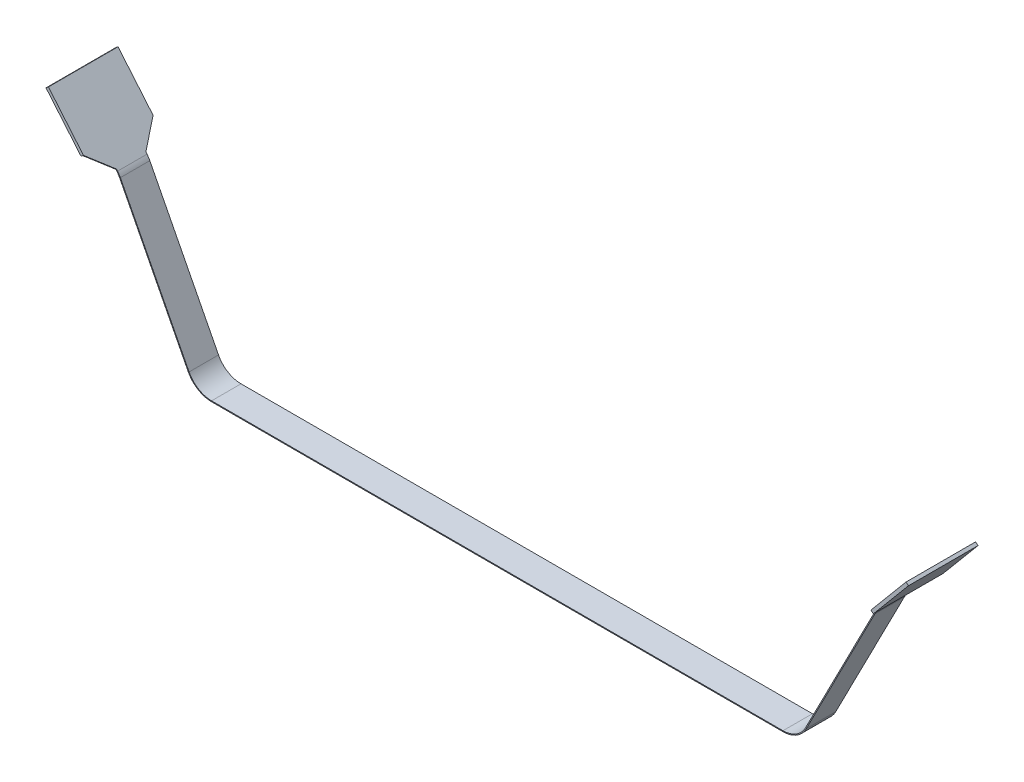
ISO-10303-21;
HEADER;
FILE_DESCRIPTION(('STEP AP214'),'2;1');
FILE_NAME('part.step','',(''),(''),'','','');
FILE_SCHEMA(('AUTOMOTIVE_DESIGN { 1 0 10303 214 1 1 1 1 }'));
ENDSEC;
DATA;
#1=APPLICATION_CONTEXT('core data for automotive mechanical design processes');
#2=APPLICATION_PROTOCOL_DEFINITION('international standard','automotive_design',2000,#1);
#3=PRODUCT_CONTEXT('',#1,'mechanical');
#4=PRODUCT('Part','Part','',(#3));
#5=PRODUCT_RELATED_PRODUCT_CATEGORY('part','',(#4));
#6=PRODUCT_DEFINITION_FORMATION('','',#4);
#7=PRODUCT_DEFINITION_CONTEXT('part definition',#1,'design');
#8=PRODUCT_DEFINITION('design','',#6,#7);
#9=PRODUCT_DEFINITION_SHAPE('','',#8);
#10=(LENGTH_UNIT() NAMED_UNIT(*) SI_UNIT(.MILLI.,.METRE.));
#11=(NAMED_UNIT(*) PLANE_ANGLE_UNIT() SI_UNIT($,.RADIAN.));
#12=(NAMED_UNIT(*) SI_UNIT($,.STERADIAN.) SOLID_ANGLE_UNIT());
#13=UNCERTAINTY_MEASURE_WITH_UNIT(LENGTH_MEASURE(1.E-05),#10,'distance_accuracy_value','');
#14=(GEOMETRIC_REPRESENTATION_CONTEXT(3) GLOBAL_UNCERTAINTY_ASSIGNED_CONTEXT((#13)) GLOBAL_UNIT_ASSIGNED_CONTEXT((#10,
#11,#12)) REPRESENTATION_CONTEXT('',''));
#15=CARTESIAN_POINT('',(0.,0.,0.));
#16=DIRECTION('',(0.,0.,1.));
#17=DIRECTION('',(1.,0.,0.));
#18=AXIS2_PLACEMENT_3D('',#15,#16,#17);
#19=CARTESIAN_POINT('',(-174.96483840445,-29.3539118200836,15.954));
#20=DIRECTION('',(0.766044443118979,0.642787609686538,0.));
#21=DIRECTION('',(-0.642787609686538,0.766044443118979,0.));
#22=AXIS2_PLACEMENT_3D('',#19,#20,#21);
#23=PLANE('',#22);
#24=DIRECTION('',(0.,0.,1.));
#25=VECTOR('',#24,1.);
#26=CARTESIAN_POINT('',(-180.881055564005,-22.3032387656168,-15.954));
#27=LINE('',#26,#25);
#28=CARTESIAN_POINT('',(-180.881055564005,-22.3032387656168,-15.954));
#29=VERTEX_POINT('',#28);
#30=CARTESIAN_POINT('',(-180.881055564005,-22.3032387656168,15.954));
#31=VERTEX_POINT('',#30);
#32=EDGE_CURVE('E306',#29,#31,#27,.T.);
#33=ORIENTED_EDGE('',*,*,#32,.F.);
#34=DIRECTION('',(0.454519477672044,-0.541675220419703,0.707106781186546));
#35=VECTOR('',#34,1.);
#36=CARTESIAN_POINT('',(-174.96483840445,-29.3539118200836,-6.75000000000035));
#37=LINE('',#36,#35);
#38=CARTESIAN_POINT('',(-174.96483840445,-29.3539118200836,-6.75000000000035));
#39=VERTEX_POINT('',#38);
#40=EDGE_CURVE('E327',#29,#39,#37,.T.);
#41=ORIENTED_EDGE('',*,*,#40,.T.);
#42=DIRECTION('',(0.,0.,1.));
#43=VECTOR('',#42,1.);
#44=CARTESIAN_POINT('',(-174.96483840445,-29.3539118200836,6.75000000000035));
#45=LINE('',#44,#43);
#46=CARTESIAN_POINT('',(-174.96483840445,-29.3539118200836,6.75000000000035));
#47=VERTEX_POINT('',#46);
#48=EDGE_CURVE('E329',#39,#47,#45,.T.);
#49=ORIENTED_EDGE('',*,*,#48,.T.);
#50=DIRECTION('',(-0.454519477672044,0.541675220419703,0.707106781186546));
#51=VECTOR('',#50,1.);
#52=CARTESIAN_POINT('',(-174.96483840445,-29.3539118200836,6.75000000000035));
#53=LINE('',#52,#51);
#54=EDGE_CURVE('E332',#47,#31,#53,.T.);
#55=ORIENTED_EDGE('',*,*,#54,.T.);
#56=EDGE_LOOP('',(#33,#41,#49,#55));
#57=FACE_BOUND('',#56,.T.);
#58=ADVANCED_FACE('F31',(#57),#23,.F.);
#59=CARTESIAN_POINT('',(-196.912443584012,-3.11998830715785,-6.75000000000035));
#60=DIRECTION('',(0.76604444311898,0.642787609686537,0.));
#61=DIRECTION('',(-0.642787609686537,0.76604444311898,0.));
#62=AXIS2_PLACEMENT_3D('',#59,#60,#61);
#63=PLANE('',#62);
#64=DIRECTION('',(0.,0.,1.));
#65=VECTOR('',#64,1.);
#66=CARTESIAN_POINT('',(-174.926536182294,-29.3217724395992,-6.75000000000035));
#67=LINE('',#66,#65);
#68=CARTESIAN_POINT('',(-174.926536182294,-29.3217724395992,-6.75000000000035));
#69=VERTEX_POINT('',#68);
#70=CARTESIAN_POINT('',(-174.926536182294,-29.3217724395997,6.74999999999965));
#71=VERTEX_POINT('',#70);
#72=EDGE_CURVE('E361',#69,#71,#67,.T.);
#73=ORIENTED_EDGE('',*,*,#72,.F.);
#74=DIRECTION('',(-0.642787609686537,0.76604444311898,0.));
#75=VECTOR('',#74,1.);
#76=CARTESIAN_POINT('',(-196.912443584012,-3.11998830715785,-6.75000000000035));
#77=LINE('',#76,#75);
#78=CARTESIAN_POINT('',(-174.414877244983,-29.9315438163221,-6.75000000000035));
#79=VERTEX_POINT('',#78);
#80=EDGE_CURVE('E365',#79,#69,#77,.T.);
#81=ORIENTED_EDGE('',*,*,#80,.F.);
#82=DIRECTION('',(0.,0.,1.));
#83=VECTOR('',#82,1.);
#84=CARTESIAN_POINT('',(-174.414877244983,-29.9315438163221,-6.75000000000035));
#85=LINE('',#84,#83);
#86=CARTESIAN_POINT('',(-174.414877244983,-29.9315438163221,6.74999999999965));
#87=VERTEX_POINT('',#86);
#88=EDGE_CURVE('E410',#79,#87,#85,.T.);
#89=ORIENTED_EDGE('',*,*,#88,.T.);
#90=DIRECTION('',(-0.642787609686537,0.76604444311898,0.));
#91=VECTOR('',#90,1.);
#92=CARTESIAN_POINT('',(-196.912443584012,-3.11998830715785,6.74999999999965));
#93=LINE('',#92,#91);
#94=EDGE_CURVE('E364',#87,#71,#93,.T.);
#95=ORIENTED_EDGE('',*,*,#94,.T.);
#96=EDGE_LOOP('',(#73,#81,#89,#95));
#97=FACE_BOUND('',#96,.T.);
#98=ADVANCED_FACE('F33',(#97),#63,.F.);
#99=CARTESIAN_POINT('',(-182.075321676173,-36.3594199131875,-6.75000000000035));
#100=DIRECTION('',(0.,0.,-1.));
#101=DIRECTION('',(-1.,0.,0.));
#102=AXIS2_PLACEMENT_3D('',#99,#100,#101);
#103=PLANE('',#102);
#104=DIRECTION('',(-0.766044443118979,0.642787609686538,0.));
#105=VECTOR('',#104,1.);
#106=CARTESIAN_POINT('',(174.96483840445,-29.3539118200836,-6.75000000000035));
#107=LINE('',#106,#105);
#108=CARTESIAN_POINT('',(174.926536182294,-29.3217724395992,-6.75000000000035));
#109=VERTEX_POINT('',#108);
#110=CARTESIAN_POINT('',(174.620118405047,-29.0646573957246,-6.75000000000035));
#111=VERTEX_POINT('',#110);
#112=EDGE_CURVE('E297',#109,#111,#107,.T.);
#113=ORIENTED_EDGE('',*,*,#112,.F.);
#114=DIRECTION('',(-0.642787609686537,-0.76604444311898,0.));
#115=VECTOR('',#114,1.);
#116=CARTESIAN_POINT('',(196.912443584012,-3.11998830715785,-6.75000000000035));
#117=LINE('',#116,#115);
#118=CARTESIAN_POINT('',(174.414877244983,-29.9315438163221,-6.75000000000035));
#119=VERTEX_POINT('',#118);
#120=EDGE_CURVE('E394',#109,#119,#117,.T.);
#121=ORIENTED_EDGE('',*,*,#120,.T.);
#122=CARTESIAN_POINT('',(182.075321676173,-36.3594199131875,-6.75000000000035));
#123=DIRECTION('',(0.,0.,1.));
#124=DIRECTION('',(1.,0.,0.));
#125=AXIS2_PLACEMENT_3D('',#122,#123,#124);
#126=CIRCLE('',#125,10.);
#127=CARTESIAN_POINT('',(173.178162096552,-31.7942746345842,-6.75000000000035));
#128=VERTEX_POINT('',#127);
#129=EDGE_CURVE('E396',#119,#128,#126,.T.);
#130=ORIENTED_EDGE('',*,*,#129,.T.);
#131=DIRECTION('',(-0.456514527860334,-0.889715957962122,0.));
#132=VECTOR('',#131,1.);
#133=CARTESIAN_POINT('',(173.178162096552,-31.7942746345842,-6.75000000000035));
#134=LINE('',#133,#132);
#135=CARTESIAN_POINT('',(141.676591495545,-93.188706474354,-6.75000000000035));
#136=VERTEX_POINT('',#135);
#137=EDGE_CURVE('E398',#128,#136,#134,.T.);
#138=ORIENTED_EDGE('',*,*,#137,.T.);
#139=CARTESIAN_POINT('',(131.,-87.71053214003,-6.75000000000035));
#140=DIRECTION('',(0.,0.,-1.));
#141=DIRECTION('',(1.,0.,0.));
#142=AXIS2_PLACEMENT_3D('',#139,#140,#141);
#143=CIRCLE('',#142,12.);
#144=CARTESIAN_POINT('',(131.,-99.71053214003,-6.75000000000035));
#145=VERTEX_POINT('',#144);
#146=EDGE_CURVE('E400',#136,#145,#143,.T.);
#147=ORIENTED_EDGE('',*,*,#146,.T.);
#148=DIRECTION('',(-1.,0.,0.));
#149=VECTOR('',#148,1.);
#150=CARTESIAN_POINT('',(-131.,-99.71053214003,-6.75000000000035));
#151=LINE('',#150,#149);
#152=CARTESIAN_POINT('',(-131.,-99.71053214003,-6.75000000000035));
#153=VERTEX_POINT('',#152);
#154=EDGE_CURVE('E402',#145,#153,#151,.T.);
#155=ORIENTED_EDGE('',*,*,#154,.T.);
#156=CARTESIAN_POINT('',(-131.,-87.71053214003,-6.75000000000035));
#157=DIRECTION('',(0.,0.,-1.));
#158=DIRECTION('',(-1.,0.,0.));
#159=AXIS2_PLACEMENT_3D('',#156,#157,#158);
#160=CIRCLE('',#159,12.);
#161=CARTESIAN_POINT('',(-141.676591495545,-93.188706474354,-6.75000000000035));
#162=VERTEX_POINT('',#161);
#163=EDGE_CURVE('E404',#153,#162,#160,.T.);
#164=ORIENTED_EDGE('',*,*,#163,.T.);
#165=DIRECTION('',(-0.456514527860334,0.889715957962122,0.));
#166=VECTOR('',#165,1.);
#167=CARTESIAN_POINT('',(-173.178162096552,-31.7942746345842,-6.75000000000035));
#168=LINE('',#167,#166);
#169=CARTESIAN_POINT('',(-173.178162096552,-31.7942746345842,-6.75000000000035));
#170=VERTEX_POINT('',#169);
#171=EDGE_CURVE('E406',#162,#170,#168,.T.);
#172=ORIENTED_EDGE('',*,*,#171,.T.);
#173=CARTESIAN_POINT('',(-182.075321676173,-36.3594199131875,-6.75000000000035));
#174=DIRECTION('',(0.,0.,1.));
#175=DIRECTION('',(-1.,0.,0.));
#176=AXIS2_PLACEMENT_3D('',#173,#174,#175);
#177=CIRCLE('',#176,10.);
#178=EDGE_CURVE('E408',#170,#79,#177,.T.);
#179=ORIENTED_EDGE('',*,*,#178,.T.);
#180=ORIENTED_EDGE('',*,*,#80,.T.);
#181=DIRECTION('',(0.766044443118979,0.642787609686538,0.));
#182=VECTOR('',#181,1.);
#183=CARTESIAN_POINT('',(-174.96483840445,-29.3539118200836,-6.75000000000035));
#184=LINE('',#183,#182);
#185=CARTESIAN_POINT('',(-174.620118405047,-29.0646573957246,-6.75000000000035));
#186=VERTEX_POINT('',#185);
#187=EDGE_CURVE('E348',#69,#186,#184,.T.);
#188=ORIENTED_EDGE('',*,*,#187,.T.);
#189=DIRECTION('',(-0.642787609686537,0.76604444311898,0.));
#190=VECTOR('',#189,1.);
#191=CARTESIAN_POINT('',(-196.606025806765,-2.86287326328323,-6.75000000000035));
#192=LINE('',#191,#190);
#193=CARTESIAN_POINT('',(-174.108459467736,-29.6744287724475,-6.75000000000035));
#194=VERTEX_POINT('',#193);
#195=EDGE_CURVE('E368',#194,#186,#192,.T.);
#196=ORIENTED_EDGE('',*,*,#195,.F.);
#197=CARTESIAN_POINT('',(-182.075321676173,-36.3594199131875,-6.75000000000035));
#198=DIRECTION('',(0.,0.,-1.));
#199=DIRECTION('',(1.,0.,0.));
#200=AXIS2_PLACEMENT_3D('',#197,#198,#199);
#201=CIRCLE('',#200,10.4);
#202=CARTESIAN_POINT('',(-172.822275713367,-31.61166882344,-6.75000000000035));
#203=VERTEX_POINT('',#202);
#204=EDGE_CURVE('E372',#203,#194,#201,.F.);
#205=ORIENTED_EDGE('',*,*,#204,.F.);
#206=DIRECTION('',(-0.456514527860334,0.889715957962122,0.));
#207=VECTOR('',#206,1.);
#208=CARTESIAN_POINT('',(-172.822275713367,-31.61166882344,-6.75000000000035));
#209=LINE('',#208,#207);
#210=CARTESIAN_POINT('',(-141.320705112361,-93.0061006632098,-6.75000000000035));
#211=VERTEX_POINT('',#210);
#212=EDGE_CURVE('E375',#211,#203,#209,.T.);
#213=ORIENTED_EDGE('',*,*,#212,.F.);
#214=CARTESIAN_POINT('',(-131.,-87.71053214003,-6.75000000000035));
#215=DIRECTION('',(0.,0.,-1.));
#216=DIRECTION('',(1.,0.,0.));
#217=AXIS2_PLACEMENT_3D('',#214,#215,#216);
#218=CIRCLE('',#217,11.6);
#219=CARTESIAN_POINT('',(-131.,-99.31053214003,-6.75000000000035));
#220=VERTEX_POINT('',#219);
#221=EDGE_CURVE('E378',#220,#211,#218,.T.);
#222=ORIENTED_EDGE('',*,*,#221,.F.);
#223=DIRECTION('',(1.,0.,0.));
#224=VECTOR('',#223,1.);
#225=CARTESIAN_POINT('',(-131.,-99.31053214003,-6.75000000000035));
#226=LINE('',#225,#224);
#227=CARTESIAN_POINT('',(131.,-99.31053214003,-6.75000000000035));
#228=VERTEX_POINT('',#227);
#229=EDGE_CURVE('E381',#228,#220,#226,.F.);
#230=ORIENTED_EDGE('',*,*,#229,.F.);
#231=CARTESIAN_POINT('',(131.,-87.71053214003,-6.75000000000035));
#232=DIRECTION('',(0.,0.,-1.));
#233=DIRECTION('',(1.,0.,0.));
#234=AXIS2_PLACEMENT_3D('',#231,#232,#233);
#235=CIRCLE('',#234,11.6);
#236=CARTESIAN_POINT('',(141.320705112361,-93.0061006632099,-6.75000000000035));
#237=VERTEX_POINT('',#236);
#238=EDGE_CURVE('E384',#237,#228,#235,.T.);
#239=ORIENTED_EDGE('',*,*,#238,.F.);
#240=DIRECTION('',(-0.456514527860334,-0.889715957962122,0.));
#241=VECTOR('',#240,1.);
#242=CARTESIAN_POINT('',(172.822275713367,-31.61166882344,-6.75000000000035));
#243=LINE('',#242,#241);
#244=CARTESIAN_POINT('',(172.822275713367,-31.61166882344,-6.75000000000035));
#245=VERTEX_POINT('',#244);
#246=EDGE_CURVE('E387',#245,#237,#243,.T.);
#247=ORIENTED_EDGE('',*,*,#246,.F.);
#248=CARTESIAN_POINT('',(182.075321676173,-36.3594199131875,-6.75000000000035));
#249=DIRECTION('',(0.,0.,-1.));
#250=DIRECTION('',(1.,0.,0.));
#251=AXIS2_PLACEMENT_3D('',#248,#249,#250);
#252=CIRCLE('',#251,10.4);
#253=CARTESIAN_POINT('',(174.108459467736,-29.6744287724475,-6.75000000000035));
#254=VERTEX_POINT('',#253);
#255=EDGE_CURVE('E390',#254,#245,#252,.F.);
#256=ORIENTED_EDGE('',*,*,#255,.F.);
#257=DIRECTION('',(-0.642787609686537,-0.76604444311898,0.));
#258=VECTOR('',#257,1.);
#259=CARTESIAN_POINT('',(196.606025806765,-2.86287326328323,-6.75000000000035));
#260=LINE('',#259,#258);
#261=EDGE_CURVE('E46',#111,#254,#260,.T.);
#262=ORIENTED_EDGE('',*,*,#261,.F.);
#263=EDGE_LOOP('',(#113,#121,#130,#138,#147,#155,#164,#172,#179,#180,#188,#196,#205,#213,#222,
#230,#239,#247,#256,#262));
#264=FACE_BOUND('',#263,.T.);
#265=ADVANCED_FACE('F532',(#264),#103,.T.);
#266=CARTESIAN_POINT('',(-182.075321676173,-36.3594199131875,6.74999999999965));
#267=DIRECTION('',(0.,0.,-1.));
#268=DIRECTION('',(-1.,0.,0.));
#269=AXIS2_PLACEMENT_3D('',#266,#267,#268);
#270=PLANE('',#269);
#271=DIRECTION('',(-0.642787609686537,-0.76604444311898,0.));
#272=VECTOR('',#271,1.);
#273=CARTESIAN_POINT('',(196.912443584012,-3.11998830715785,6.74999999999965));
#274=LINE('',#273,#272);
#275=CARTESIAN_POINT('',(174.926536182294,-29.3217724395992,6.74999999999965));
#276=VERTEX_POINT('',#275);
#277=CARTESIAN_POINT('',(174.414877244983,-29.9315438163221,6.74999999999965));
#278=VERTEX_POINT('',#277);
#279=EDGE_CURVE('E438',#276,#278,#274,.T.);
#280=ORIENTED_EDGE('',*,*,#279,.F.);
#281=DIRECTION('',(-0.766044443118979,0.642787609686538,0.));
#282=VECTOR('',#281,1.);
#283=CARTESIAN_POINT('',(174.96483840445,-29.3539118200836,6.75000000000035));
#284=LINE('',#283,#282);
#285=CARTESIAN_POINT('',(174.620118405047,-29.0646573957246,6.74999999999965));
#286=VERTEX_POINT('',#285);
#287=EDGE_CURVE('E54',#276,#286,#284,.T.);
#288=ORIENTED_EDGE('',*,*,#287,.T.);
#289=DIRECTION('',(-0.642787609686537,-0.76604444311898,0.));
#290=VECTOR('',#289,1.);
#291=CARTESIAN_POINT('',(196.606025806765,-2.86287326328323,6.74999999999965));
#292=LINE('',#291,#290);
#293=CARTESIAN_POINT('',(174.108459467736,-29.6744287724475,6.74999999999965));
#294=VERTEX_POINT('',#293);
#295=EDGE_CURVE('E436',#286,#294,#292,.T.);
#296=ORIENTED_EDGE('',*,*,#295,.T.);
#297=CARTESIAN_POINT('',(182.075321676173,-36.3594199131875,6.74999999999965));
#298=DIRECTION('',(0.,0.,-1.));
#299=DIRECTION('',(1.,0.,0.));
#300=AXIS2_PLACEMENT_3D('',#297,#298,#299);
#301=CIRCLE('',#300,10.4);
#302=CARTESIAN_POINT('',(172.822275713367,-31.61166882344,6.74999999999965));
#303=VERTEX_POINT('',#302);
#304=EDGE_CURVE('E433',#294,#303,#301,.F.);
#305=ORIENTED_EDGE('',*,*,#304,.T.);
#306=DIRECTION('',(-0.456514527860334,-0.889715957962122,0.));
#307=VECTOR('',#306,1.);
#308=CARTESIAN_POINT('',(172.822275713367,-31.61166882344,6.74999999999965));
#309=LINE('',#308,#307);
#310=CARTESIAN_POINT('',(141.320705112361,-93.0061006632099,6.74999999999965));
#311=VERTEX_POINT('',#310);
#312=EDGE_CURVE('E430',#303,#311,#309,.T.);
#313=ORIENTED_EDGE('',*,*,#312,.T.);
#314=CARTESIAN_POINT('',(131.,-87.71053214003,6.74999999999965));
#315=DIRECTION('',(0.,0.,-1.));
#316=DIRECTION('',(1.,0.,0.));
#317=AXIS2_PLACEMENT_3D('',#314,#315,#316);
#318=CIRCLE('',#317,11.6);
#319=CARTESIAN_POINT('',(131.,-99.31053214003,6.74999999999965));
#320=VERTEX_POINT('',#319);
#321=EDGE_CURVE('E427',#311,#320,#318,.T.);
#322=ORIENTED_EDGE('',*,*,#321,.T.);
#323=DIRECTION('',(1.,0.,0.));
#324=VECTOR('',#323,1.);
#325=CARTESIAN_POINT('',(-131.,-99.31053214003,6.74999999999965));
#326=LINE('',#325,#324);
#327=CARTESIAN_POINT('',(-131.,-99.31053214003,6.74999999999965));
#328=VERTEX_POINT('',#327);
#329=EDGE_CURVE('E424',#320,#328,#326,.F.);
#330=ORIENTED_EDGE('',*,*,#329,.T.);
#331=CARTESIAN_POINT('',(-131.,-87.71053214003,6.74999999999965));
#332=DIRECTION('',(0.,0.,-1.));
#333=DIRECTION('',(1.,0.,0.));
#334=AXIS2_PLACEMENT_3D('',#331,#332,#333);
#335=CIRCLE('',#334,11.6);
#336=CARTESIAN_POINT('',(-141.320705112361,-93.0061006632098,6.74999999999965));
#337=VERTEX_POINT('',#336);
#338=EDGE_CURVE('E421',#328,#337,#335,.T.);
#339=ORIENTED_EDGE('',*,*,#338,.T.);
#340=DIRECTION('',(-0.456514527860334,0.889715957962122,0.));
#341=VECTOR('',#340,1.);
#342=CARTESIAN_POINT('',(-172.822275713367,-31.61166882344,6.74999999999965));
#343=LINE('',#342,#341);
#344=CARTESIAN_POINT('',(-172.822275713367,-31.61166882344,6.74999999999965));
#345=VERTEX_POINT('',#344);
#346=EDGE_CURVE('E418',#337,#345,#343,.T.);
#347=ORIENTED_EDGE('',*,*,#346,.T.);
#348=CARTESIAN_POINT('',(-182.075321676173,-36.3594199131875,6.74999999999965));
#349=DIRECTION('',(0.,0.,-1.));
#350=DIRECTION('',(1.,0.,0.));
#351=AXIS2_PLACEMENT_3D('',#348,#349,#350);
#352=CIRCLE('',#351,10.4);
#353=CARTESIAN_POINT('',(-174.108459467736,-29.6744287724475,6.74999999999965));
#354=VERTEX_POINT('',#353);
#355=EDGE_CURVE('E415',#345,#354,#352,.F.);
#356=ORIENTED_EDGE('',*,*,#355,.T.);
#357=DIRECTION('',(-0.642787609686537,0.76604444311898,0.));
#358=VECTOR('',#357,1.);
#359=CARTESIAN_POINT('',(-196.606025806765,-2.86287326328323,6.74999999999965));
#360=LINE('',#359,#358);
#361=CARTESIAN_POINT('',(-174.620118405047,-29.0646573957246,6.74999999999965));
#362=VERTEX_POINT('',#361);
#363=EDGE_CURVE('E413',#354,#362,#360,.T.);
#364=ORIENTED_EDGE('',*,*,#363,.T.);
#365=DIRECTION('',(0.766044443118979,0.642787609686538,0.));
#366=VECTOR('',#365,1.);
#367=CARTESIAN_POINT('',(-182.586980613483,-35.7496485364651,6.74999999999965));
#368=LINE('',#367,#366);
#369=EDGE_CURVE('E39',#71,#362,#368,.T.);
#370=ORIENTED_EDGE('',*,*,#369,.F.);
#371=ORIENTED_EDGE('',*,*,#94,.F.);
#372=CARTESIAN_POINT('',(-182.075321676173,-36.3594199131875,6.74999999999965));
#373=DIRECTION('',(0.,0.,1.));
#374=DIRECTION('',(-1.,0.,0.));
#375=AXIS2_PLACEMENT_3D('',#372,#373,#374);
#376=CIRCLE('',#375,10.);
#377=CARTESIAN_POINT('',(-173.178162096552,-31.7942746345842,6.74999999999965));
#378=VERTEX_POINT('',#377);
#379=EDGE_CURVE('E369',#378,#87,#376,.T.);
#380=ORIENTED_EDGE('',*,*,#379,.F.);
#381=DIRECTION('',(-0.456514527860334,0.889715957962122,0.));
#382=VECTOR('',#381,1.);
#383=CARTESIAN_POINT('',(-173.178162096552,-31.7942746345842,6.74999999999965));
#384=LINE('',#383,#382);
#385=CARTESIAN_POINT('',(-141.676591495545,-93.188706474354,6.74999999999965));
#386=VERTEX_POINT('',#385);
#387=EDGE_CURVE('E450',#386,#378,#384,.T.);
#388=ORIENTED_EDGE('',*,*,#387,.F.);
#389=CARTESIAN_POINT('',(-131.,-87.71053214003,6.74999999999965));
#390=DIRECTION('',(0.,0.,-1.));
#391=DIRECTION('',(-1.,0.,0.));
#392=AXIS2_PLACEMENT_3D('',#389,#390,#391);
#393=CIRCLE('',#392,12.);
#394=CARTESIAN_POINT('',(-131.,-99.71053214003,6.74999999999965));
#395=VERTEX_POINT('',#394);
#396=EDGE_CURVE('E448',#395,#386,#393,.T.);
#397=ORIENTED_EDGE('',*,*,#396,.F.);
#398=DIRECTION('',(-1.,0.,0.));
#399=VECTOR('',#398,1.);
#400=CARTESIAN_POINT('',(-131.,-99.71053214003,6.74999999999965));
#401=LINE('',#400,#399);
#402=CARTESIAN_POINT('',(131.,-99.71053214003,6.74999999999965));
#403=VERTEX_POINT('',#402);
#404=EDGE_CURVE('E446',#403,#395,#401,.T.);
#405=ORIENTED_EDGE('',*,*,#404,.F.);
#406=CARTESIAN_POINT('',(131.,-87.71053214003,6.74999999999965));
#407=DIRECTION('',(0.,0.,-1.));
#408=DIRECTION('',(1.,0.,0.));
#409=AXIS2_PLACEMENT_3D('',#406,#407,#408);
#410=CIRCLE('',#409,12.);
#411=CARTESIAN_POINT('',(141.676591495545,-93.188706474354,6.74999999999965));
#412=VERTEX_POINT('',#411);
#413=EDGE_CURVE('E444',#412,#403,#410,.T.);
#414=ORIENTED_EDGE('',*,*,#413,.F.);
#415=DIRECTION('',(-0.456514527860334,-0.889715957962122,0.));
#416=VECTOR('',#415,1.);
#417=CARTESIAN_POINT('',(173.178162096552,-31.7942746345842,6.74999999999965));
#418=LINE('',#417,#416);
#419=CARTESIAN_POINT('',(173.178162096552,-31.7942746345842,6.74999999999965));
#420=VERTEX_POINT('',#419);
#421=EDGE_CURVE('E442',#420,#412,#418,.T.);
#422=ORIENTED_EDGE('',*,*,#421,.F.);
#423=CARTESIAN_POINT('',(182.075321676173,-36.3594199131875,6.74999999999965));
#424=DIRECTION('',(0.,0.,1.));
#425=DIRECTION('',(1.,0.,0.));
#426=AXIS2_PLACEMENT_3D('',#423,#424,#425);
#427=CIRCLE('',#426,10.);
#428=EDGE_CURVE('E440',#278,#420,#427,.T.);
#429=ORIENTED_EDGE('',*,*,#428,.F.);
#430=EDGE_LOOP('',(#280,#288,#296,#305,#313,#322,#330,#339,#347,#356,#364,#370,#371,#380,#388,
#397,#405,#414,#422,#429));
#431=FACE_BOUND('',#430,.T.);
#432=ADVANCED_FACE('F541',(#431),#270,.F.);
#433=CARTESIAN_POINT('',(-196.606025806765,-2.86287326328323,-6.75000000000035));
#434=DIRECTION('',(-0.642787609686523,0.766044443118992,0.));
#435=DIRECTION('',(-0.766044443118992,-0.642787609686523,0.));
#436=AXIS2_PLACEMENT_3D('',#433,#434,#435);
#437=PLANE('',#436);
#438=DIRECTION('',(0.,0.,1.));
#439=VECTOR('',#438,1.);
#440=CARTESIAN_POINT('',(-196.606025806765,-2.86287326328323,-6.75000000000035));
#441=LINE('',#440,#439);
#442=CARTESIAN_POINT('',(-196.606025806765,-2.86287326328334,-15.954));
#443=VERTEX_POINT('',#442);
#444=CARTESIAN_POINT('',(-196.606025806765,-2.86287326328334,15.954));
#445=VERTEX_POINT('',#444);
#446=EDGE_CURVE('E495',#443,#445,#441,.T.);
#447=ORIENTED_EDGE('',*,*,#446,.F.);
#448=DIRECTION('',(0.766044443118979,0.642787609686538,0.));
#449=VECTOR('',#448,1.);
#450=CARTESIAN_POINT('',(-196.950745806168,-3.15212768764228,-15.954));
#451=LINE('',#450,#449);
#452=CARTESIAN_POINT('',(-197.716790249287,-3.79491529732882,-15.954));
#453=VERTEX_POINT('',#452);
#454=EDGE_CURVE('E355',#453,#443,#451,.T.);
#455=ORIENTED_EDGE('',*,*,#454,.F.);
#456=DIRECTION('',(0.,0.,-1.));
#457=VECTOR('',#456,1.);
#458=CARTESIAN_POINT('',(-197.716790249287,-3.79491529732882,-15.954));
#459=LINE('',#458,#457);
#460=CARTESIAN_POINT('',(-197.716790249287,-3.79491529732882,15.954));
#461=VERTEX_POINT('',#460);
#462=EDGE_CURVE('E315',#461,#453,#459,.T.);
#463=ORIENTED_EDGE('',*,*,#462,.F.);
#464=DIRECTION('',(0.766044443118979,0.642787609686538,0.));
#465=VECTOR('',#464,1.);
#466=CARTESIAN_POINT('',(-196.950745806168,-3.15212768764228,15.954));
#467=LINE('',#466,#465);
#468=EDGE_CURVE('E358',#461,#445,#467,.T.);
#469=ORIENTED_EDGE('',*,*,#468,.T.);
#470=EDGE_LOOP('',(#447,#455,#463,#469));
#471=FACE_BOUND('',#470,.T.);
#472=ADVANCED_FACE('F631',(#471),#437,.T.);
#473=CARTESIAN_POINT('',(-196.606025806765,-2.86287326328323,-6.75000000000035));
#474=DIRECTION('',(0.76604444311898,0.642787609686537,0.));
#475=DIRECTION('',(-0.642787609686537,0.76604444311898,0.));
#476=AXIS2_PLACEMENT_3D('',#473,#474,#475);
#477=PLANE('',#476);
#478=DIRECTION('',(-0.454519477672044,0.541675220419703,0.707106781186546));
#479=VECTOR('',#478,1.);
#480=CARTESIAN_POINT('',(-174.620118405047,-29.0646573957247,6.75000000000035));
#481=LINE('',#480,#479);
#482=CARTESIAN_POINT('',(-180.536335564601,-22.0139843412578,15.954));
#483=VERTEX_POINT('',#482);
#484=EDGE_CURVE('E330',#362,#483,#481,.T.);
#485=ORIENTED_EDGE('',*,*,#484,.F.);
#486=ORIENTED_EDGE('',*,*,#363,.F.);
#487=DIRECTION('',(0.,0.,1.));
#488=VECTOR('',#487,1.);
#489=CARTESIAN_POINT('',(-174.108459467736,-29.6744287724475,-6.75000000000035));
#490=LINE('',#489,#488);
#491=EDGE_CURVE('E493',#194,#354,#490,.T.);
#492=ORIENTED_EDGE('',*,*,#491,.F.);
#493=ORIENTED_EDGE('',*,*,#195,.T.);
#494=DIRECTION('',(0.454519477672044,-0.541675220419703,0.707106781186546));
#495=VECTOR('',#494,1.);
#496=CARTESIAN_POINT('',(-174.620118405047,-29.0646573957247,-6.75000000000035));
#497=LINE('',#496,#495);
#498=CARTESIAN_POINT('',(-180.536335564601,-22.0139843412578,-15.954));
#499=VERTEX_POINT('',#498);
#500=EDGE_CURVE('E339',#499,#186,#497,.T.);
#501=ORIENTED_EDGE('',*,*,#500,.F.);
#502=DIRECTION('',(0.642787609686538,-0.766044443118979,0.));
#503=VECTOR('',#502,1.);
#504=CARTESIAN_POINT('',(-196.606025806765,-2.86287326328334,-15.954));
#505=LINE('',#504,#503);
#506=EDGE_CURVE('E337',#443,#499,#505,.T.);
#507=ORIENTED_EDGE('',*,*,#506,.F.);
#508=ORIENTED_EDGE('',*,*,#446,.T.);
#509=DIRECTION('',(-0.642787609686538,0.766044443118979,0.));
#510=VECTOR('',#509,1.);
#511=CARTESIAN_POINT('',(-196.606025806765,-2.86287326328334,15.954));
#512=LINE('',#511,#510);
#513=EDGE_CURVE('E326',#483,#445,#512,.T.);
#514=ORIENTED_EDGE('',*,*,#513,.F.);
#515=EDGE_LOOP('',(#485,#486,#492,#493,#501,#507,#508,#514));
#516=FACE_BOUND('',#515,.T.);
#517=ADVANCED_FACE('F507',(#516),#477,.T.);
#518=CARTESIAN_POINT('',(-182.075321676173,-36.3594199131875,-6.75000000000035));
#519=DIRECTION('',(0.,0.,1.));
#520=DIRECTION('',(1.,0.,0.));
#521=AXIS2_PLACEMENT_3D('',#518,#519,#520);
#522=CYLINDRICAL_SURFACE('',#521,10.4);
#523=ORIENTED_EDGE('',*,*,#355,.F.);
#524=DIRECTION('',(0.,0.,1.));
#525=VECTOR('',#524,1.);
#526=CARTESIAN_POINT('',(-172.822275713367,-31.61166882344,-6.75000000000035));
#527=LINE('',#526,#525);
#528=EDGE_CURVE('E491',#203,#345,#527,.T.);
#529=ORIENTED_EDGE('',*,*,#528,.F.);
#530=ORIENTED_EDGE('',*,*,#204,.T.);
#531=ORIENTED_EDGE('',*,*,#491,.T.);
#532=EDGE_LOOP('',(#523,#529,#530,#531));
#533=FACE_BOUND('',#532,.T.);
#534=ADVANCED_FACE('F622',(#533),#522,.T.);
#535=CARTESIAN_POINT('',(-172.822275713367,-31.61166882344,-6.75000000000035));
#536=DIRECTION('',(0.889715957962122,0.456514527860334,0.));
#537=DIRECTION('',(-0.456514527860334,0.889715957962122,0.));
#538=AXIS2_PLACEMENT_3D('',#535,#536,#537);
#539=PLANE('',#538);
#540=ORIENTED_EDGE('',*,*,#346,.F.);
#541=DIRECTION('',(0.,0.,1.));
#542=VECTOR('',#541,1.);
#543=CARTESIAN_POINT('',(-141.320705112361,-93.0061006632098,-6.75000000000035));
#544=LINE('',#543,#542);
#545=EDGE_CURVE('E489',#211,#337,#544,.T.);
#546=ORIENTED_EDGE('',*,*,#545,.F.);
#547=ORIENTED_EDGE('',*,*,#212,.T.);
#548=ORIENTED_EDGE('',*,*,#528,.T.);
#549=EDGE_LOOP('',(#540,#546,#547,#548));
#550=FACE_BOUND('',#549,.T.);
#551=ADVANCED_FACE('F619',(#550),#539,.T.);
#552=CARTESIAN_POINT('',(-131.,-87.71053214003,-6.75000000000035));
#553=DIRECTION('',(0.,0.,1.));
#554=DIRECTION('',(1.,0.,0.));
#555=AXIS2_PLACEMENT_3D('',#552,#553,#554);
#556=CYLINDRICAL_SURFACE('',#555,11.6);
#557=ORIENTED_EDGE('',*,*,#338,.F.);
#558=DIRECTION('',(0.,0.,1.));
#559=VECTOR('',#558,1.);
#560=CARTESIAN_POINT('',(-131.,-99.31053214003,-6.75000000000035));
#561=LINE('',#560,#559);
#562=EDGE_CURVE('E487',#220,#328,#561,.T.);
#563=ORIENTED_EDGE('',*,*,#562,.F.);
#564=ORIENTED_EDGE('',*,*,#221,.T.);
#565=ORIENTED_EDGE('',*,*,#545,.T.);
#566=EDGE_LOOP('',(#557,#563,#564,#565));
#567=FACE_BOUND('',#566,.T.);
#568=ADVANCED_FACE('F615',(#567),#556,.F.);
#569=CARTESIAN_POINT('',(-131.,-99.31053214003,-6.75000000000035));
#570=DIRECTION('',(0.,1.,0.));
#571=DIRECTION('',(0.,0.,1.));
#572=AXIS2_PLACEMENT_3D('',#569,#570,#571);
#573=PLANE('',#572);
#574=ORIENTED_EDGE('',*,*,#329,.F.);
#575=DIRECTION('',(0.,0.,1.));
#576=VECTOR('',#575,1.);
#577=CARTESIAN_POINT('',(131.,-99.31053214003,-6.75000000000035));
#578=LINE('',#577,#576);
#579=EDGE_CURVE('E485',#228,#320,#578,.T.);
#580=ORIENTED_EDGE('',*,*,#579,.F.);
#581=ORIENTED_EDGE('',*,*,#229,.T.);
#582=ORIENTED_EDGE('',*,*,#562,.T.);
#583=EDGE_LOOP('',(#574,#580,#581,#582));
#584=FACE_BOUND('',#583,.T.);
#585=ADVANCED_FACE('F611',(#584),#573,.T.);
#586=CARTESIAN_POINT('',(131.,-87.71053214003,-6.75000000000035));
#587=DIRECTION('',(0.,0.,1.));
#588=DIRECTION('',(1.,0.,0.));
#589=AXIS2_PLACEMENT_3D('',#586,#587,#588);
#590=CYLINDRICAL_SURFACE('',#589,11.6);
#591=ORIENTED_EDGE('',*,*,#321,.F.);
#592=DIRECTION('',(0.,0.,1.));
#593=VECTOR('',#592,1.);
#594=CARTESIAN_POINT('',(141.320705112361,-93.0061006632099,-6.75000000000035));
#595=LINE('',#594,#593);
#596=EDGE_CURVE('E483',#237,#311,#595,.T.);
#597=ORIENTED_EDGE('',*,*,#596,.F.);
#598=ORIENTED_EDGE('',*,*,#238,.T.);
#599=ORIENTED_EDGE('',*,*,#579,.T.);
#600=EDGE_LOOP('',(#591,#597,#598,#599));
#601=FACE_BOUND('',#600,.T.);
#602=ADVANCED_FACE('F607',(#601),#590,.F.);
#603=CARTESIAN_POINT('',(172.822275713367,-31.61166882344,-6.75000000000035));
#604=DIRECTION('',(-0.889715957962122,0.456514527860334,0.));
#605=DIRECTION('',(-0.456514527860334,-0.889715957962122,0.));
#606=AXIS2_PLACEMENT_3D('',#603,#604,#605);
#607=PLANE('',#606);
#608=ORIENTED_EDGE('',*,*,#312,.F.);
#609=DIRECTION('',(0.,0.,1.));
#610=VECTOR('',#609,1.);
#611=CARTESIAN_POINT('',(172.822275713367,-31.61166882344,-6.75000000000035));
#612=LINE('',#611,#610);
#613=EDGE_CURVE('E481',#245,#303,#612,.T.);
#614=ORIENTED_EDGE('',*,*,#613,.F.);
#615=ORIENTED_EDGE('',*,*,#246,.T.);
#616=ORIENTED_EDGE('',*,*,#596,.T.);
#617=EDGE_LOOP('',(#608,#614,#615,#616));
#618=FACE_BOUND('',#617,.T.);
#619=ADVANCED_FACE('F603',(#618),#607,.T.);
#620=CARTESIAN_POINT('',(182.075321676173,-36.3594199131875,-6.75000000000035));
#621=DIRECTION('',(0.,0.,1.));
#622=DIRECTION('',(1.,0.,0.));
#623=AXIS2_PLACEMENT_3D('',#620,#621,#622);
#624=CYLINDRICAL_SURFACE('',#623,10.4);
#625=ORIENTED_EDGE('',*,*,#304,.F.);
#626=DIRECTION('',(0.,0.,1.));
#627=VECTOR('',#626,1.);
#628=CARTESIAN_POINT('',(174.108459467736,-29.6744287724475,-6.75000000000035));
#629=LINE('',#628,#627);
#630=EDGE_CURVE('E478',#254,#294,#629,.T.);
#631=ORIENTED_EDGE('',*,*,#630,.F.);
#632=ORIENTED_EDGE('',*,*,#255,.T.);
#633=ORIENTED_EDGE('',*,*,#613,.T.);
#634=EDGE_LOOP('',(#625,#631,#632,#633));
#635=FACE_BOUND('',#634,.T.);
#636=ADVANCED_FACE('F600',(#635),#624,.T.);
#637=CARTESIAN_POINT('',(196.606025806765,-2.86287326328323,-6.75000000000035));
#638=DIRECTION('',(-0.76604444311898,0.642787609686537,0.));
#639=DIRECTION('',(-0.642787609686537,-0.76604444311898,0.));
#640=AXIS2_PLACEMENT_3D('',#637,#638,#639);
#641=PLANE('',#640);
#642=ORIENTED_EDGE('',*,*,#295,.F.);
#643=DIRECTION('',(0.454519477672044,0.541675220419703,0.707106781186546));
#644=VECTOR('',#643,1.);
#645=CARTESIAN_POINT('',(174.620118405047,-29.0646573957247,6.75000000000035));
#646=LINE('',#645,#644);
#647=CARTESIAN_POINT('',(180.536335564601,-22.0139843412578,15.954));
#648=VERTEX_POINT('',#647);
#649=EDGE_CURVE('E288',#286,#648,#646,.T.);
#650=ORIENTED_EDGE('',*,*,#649,.T.);
#651=DIRECTION('',(0.642787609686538,0.766044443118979,0.));
#652=VECTOR('',#651,1.);
#653=CARTESIAN_POINT('',(196.606025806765,-2.86287326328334,15.954));
#654=LINE('',#653,#652);
#655=CARTESIAN_POINT('',(196.606025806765,-2.86287326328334,15.954));
#656=VERTEX_POINT('',#655);
#657=EDGE_CURVE('E276',#648,#656,#654,.T.);
#658=ORIENTED_EDGE('',*,*,#657,.T.);
#659=DIRECTION('',(0.,0.,1.));
#660=VECTOR('',#659,1.);
#661=CARTESIAN_POINT('',(196.606025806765,-2.86287326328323,-6.75000000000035));
#662=LINE('',#661,#660);
#663=CARTESIAN_POINT('',(196.606025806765,-2.86287326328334,-15.954));
#664=VERTEX_POINT('',#663);
#665=EDGE_CURVE('E476',#664,#656,#662,.T.);
#666=ORIENTED_EDGE('',*,*,#665,.F.);
#667=DIRECTION('',(-0.642787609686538,-0.766044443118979,0.));
#668=VECTOR('',#667,1.);
#669=CARTESIAN_POINT('',(196.606025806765,-2.86287326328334,-15.954));
#670=LINE('',#669,#668);
#671=CARTESIAN_POINT('',(180.536335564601,-22.0139843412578,-15.954));
#672=VERTEX_POINT('',#671);
#673=EDGE_CURVE('E247',#664,#672,#670,.T.);
#674=ORIENTED_EDGE('',*,*,#673,.T.);
#675=DIRECTION('',(-0.454519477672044,-0.541675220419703,0.707106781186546));
#676=VECTOR('',#675,1.);
#677=CARTESIAN_POINT('',(174.620118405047,-29.0646573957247,-6.75000000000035));
#678=LINE('',#677,#676);
#679=EDGE_CURVE('E291',#672,#111,#678,.T.);
#680=ORIENTED_EDGE('',*,*,#679,.T.);
#681=ORIENTED_EDGE('',*,*,#261,.T.);
#682=ORIENTED_EDGE('',*,*,#630,.T.);
#683=EDGE_LOOP('',(#642,#650,#658,#666,#674,#680,#681,#682));
#684=FACE_BOUND('',#683,.T.);
#685=ADVANCED_FACE('F595',(#684),#641,.T.);
#686=CARTESIAN_POINT('',(196.912443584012,-3.11998830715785,-6.75000000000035));
#687=DIRECTION('',(0.642787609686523,0.766044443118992,0.));
#688=DIRECTION('',(-0.766044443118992,0.642787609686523,0.));
#689=AXIS2_PLACEMENT_3D('',#686,#687,#688);
#690=PLANE('',#689);
#691=DIRECTION('',(-0.766044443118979,0.642787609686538,0.));
#692=VECTOR('',#691,1.);
#693=CARTESIAN_POINT('',(196.950745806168,-3.15212768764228,-15.954));
#694=LINE('',#693,#692);
#695=CARTESIAN_POINT('',(197.716790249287,-3.79491529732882,-15.954));
#696=VERTEX_POINT('',#695);
#697=EDGE_CURVE('E241',#696,#664,#694,.T.);
#698=ORIENTED_EDGE('',*,*,#697,.T.);
#699=ORIENTED_EDGE('',*,*,#665,.T.);
#700=DIRECTION('',(-0.766044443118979,0.642787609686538,0.));
#701=VECTOR('',#700,1.);
#702=CARTESIAN_POINT('',(196.950745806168,-3.15212768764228,15.954));
#703=LINE('',#702,#701);
#704=CARTESIAN_POINT('',(197.716790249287,-3.79491529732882,15.954));
#705=VERTEX_POINT('',#704);
#706=EDGE_CURVE('E251',#705,#656,#703,.T.);
#707=ORIENTED_EDGE('',*,*,#706,.F.);
#708=DIRECTION('',(0.,0.,-1.));
#709=VECTOR('',#708,1.);
#710=CARTESIAN_POINT('',(197.716790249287,-3.79491529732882,-15.954));
#711=LINE('',#710,#709);
#712=EDGE_CURVE('E257',#705,#696,#711,.T.);
#713=ORIENTED_EDGE('',*,*,#712,.T.);
#714=EDGE_LOOP('',(#698,#699,#707,#713));
#715=FACE_BOUND('',#714,.T.);
#716=ADVANCED_FACE('F263',(#715),#690,.T.);
#717=CARTESIAN_POINT('',(196.912443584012,-3.11998830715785,-6.75000000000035));
#718=DIRECTION('',(-0.76604444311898,0.642787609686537,0.));
#719=DIRECTION('',(-0.642787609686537,-0.76604444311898,0.));
#720=AXIS2_PLACEMENT_3D('',#717,#718,#719);
#721=PLANE('',#720);
#722=ORIENTED_EDGE('',*,*,#120,.F.);
#723=DIRECTION('',(0.,0.,1.));
#724=VECTOR('',#723,1.);
#725=CARTESIAN_POINT('',(174.926536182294,-29.3217724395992,-6.75000000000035));
#726=LINE('',#725,#724);
#727=EDGE_CURVE('E11',#109,#276,#726,.T.);
#728=ORIENTED_EDGE('',*,*,#727,.T.);
#729=ORIENTED_EDGE('',*,*,#279,.T.);
#730=DIRECTION('',(0.,0.,1.));
#731=VECTOR('',#730,1.);
#732=CARTESIAN_POINT('',(174.414877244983,-29.9315438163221,-6.75000000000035));
#733=LINE('',#732,#731);
#734=EDGE_CURVE('E473',#119,#278,#733,.T.);
#735=ORIENTED_EDGE('',*,*,#734,.F.);
#736=EDGE_LOOP('',(#722,#728,#729,#735));
#737=FACE_BOUND('',#736,.T.);
#738=ADVANCED_FACE('F669',(#737),#721,.F.);
#739=CARTESIAN_POINT('',(182.075321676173,-36.3594199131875,-6.75000000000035));
#740=DIRECTION('',(0.,0.,1.));
#741=DIRECTION('',(1.,0.,0.));
#742=AXIS2_PLACEMENT_3D('',#739,#740,#741);
#743=CYLINDRICAL_SURFACE('',#742,10.);
#744=ORIENTED_EDGE('',*,*,#428,.T.);
#745=DIRECTION('',(0.,0.,1.));
#746=VECTOR('',#745,1.);
#747=CARTESIAN_POINT('',(173.178162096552,-31.7942746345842,-6.75000000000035));
#748=LINE('',#747,#746);
#749=EDGE_CURVE('E470',#128,#420,#748,.T.);
#750=ORIENTED_EDGE('',*,*,#749,.F.);
#751=ORIENTED_EDGE('',*,*,#129,.F.);
#752=ORIENTED_EDGE('',*,*,#734,.T.);
#753=EDGE_LOOP('',(#744,#750,#751,#752));
#754=FACE_BOUND('',#753,.T.);
#755=ADVANCED_FACE('F569',(#754),#743,.F.);
#756=CARTESIAN_POINT('',(173.178162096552,-31.7942746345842,-6.75000000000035));
#757=DIRECTION('',(-0.889715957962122,0.456514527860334,0.));
#758=DIRECTION('',(-0.456514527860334,-0.889715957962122,0.));
#759=AXIS2_PLACEMENT_3D('',#756,#757,#758);
#760=PLANE('',#759);
#761=ORIENTED_EDGE('',*,*,#421,.T.);
#762=DIRECTION('',(0.,0.,1.));
#763=VECTOR('',#762,1.);
#764=CARTESIAN_POINT('',(141.676591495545,-93.188706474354,-6.75000000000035));
#765=LINE('',#764,#763);
#766=EDGE_CURVE('E467',#136,#412,#765,.T.);
#767=ORIENTED_EDGE('',*,*,#766,.F.);
#768=ORIENTED_EDGE('',*,*,#137,.F.);
#769=ORIENTED_EDGE('',*,*,#749,.T.);
#770=EDGE_LOOP('',(#761,#767,#768,#769));
#771=FACE_BOUND('',#770,.T.);
#772=ADVANCED_FACE('F565',(#771),#760,.F.);
#773=CARTESIAN_POINT('',(131.,-87.71053214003,-6.75000000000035));
#774=DIRECTION('',(0.,0.,1.));
#775=DIRECTION('',(1.,0.,0.));
#776=AXIS2_PLACEMENT_3D('',#773,#774,#775);
#777=CYLINDRICAL_SURFACE('',#776,12.);
#778=ORIENTED_EDGE('',*,*,#413,.T.);
#779=DIRECTION('',(0.,0.,1.));
#780=VECTOR('',#779,1.);
#781=CARTESIAN_POINT('',(131.,-99.71053214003,-6.75000000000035));
#782=LINE('',#781,#780);
#783=EDGE_CURVE('E464',#145,#403,#782,.T.);
#784=ORIENTED_EDGE('',*,*,#783,.F.);
#785=ORIENTED_EDGE('',*,*,#146,.F.);
#786=ORIENTED_EDGE('',*,*,#766,.T.);
#787=EDGE_LOOP('',(#778,#784,#785,#786));
#788=FACE_BOUND('',#787,.T.);
#789=ADVANCED_FACE('F560',(#788),#777,.T.);
#790=CARTESIAN_POINT('',(-131.,-99.71053214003,-6.75000000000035));
#791=DIRECTION('',(0.,1.,0.));
#792=DIRECTION('',(0.,0.,1.));
#793=AXIS2_PLACEMENT_3D('',#790,#791,#792);
#794=PLANE('',#793);
#795=ORIENTED_EDGE('',*,*,#404,.T.);
#796=DIRECTION('',(0.,0.,1.));
#797=VECTOR('',#796,1.);
#798=CARTESIAN_POINT('',(-131.,-99.71053214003,-6.75000000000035));
#799=LINE('',#798,#797);
#800=EDGE_CURVE('E461',#153,#395,#799,.T.);
#801=ORIENTED_EDGE('',*,*,#800,.F.);
#802=ORIENTED_EDGE('',*,*,#154,.F.);
#803=ORIENTED_EDGE('',*,*,#783,.T.);
#804=EDGE_LOOP('',(#795,#801,#802,#803));
#805=FACE_BOUND('',#804,.T.);
#806=ADVANCED_FACE('F554',(#805),#794,.F.);
#807=CARTESIAN_POINT('',(-131.,-87.71053214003,-6.75000000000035));
#808=DIRECTION('',(0.,0.,1.));
#809=DIRECTION('',(1.,0.,0.));
#810=AXIS2_PLACEMENT_3D('',#807,#808,#809);
#811=CYLINDRICAL_SURFACE('',#810,12.);
#812=ORIENTED_EDGE('',*,*,#396,.T.);
#813=DIRECTION('',(0.,0.,1.));
#814=VECTOR('',#813,1.);
#815=CARTESIAN_POINT('',(-141.676591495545,-93.188706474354,-6.75000000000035));
#816=LINE('',#815,#814);
#817=EDGE_CURVE('E458',#162,#386,#816,.T.);
#818=ORIENTED_EDGE('',*,*,#817,.F.);
#819=ORIENTED_EDGE('',*,*,#163,.F.);
#820=ORIENTED_EDGE('',*,*,#800,.T.);
#821=EDGE_LOOP('',(#812,#818,#819,#820));
#822=FACE_BOUND('',#821,.T.);
#823=ADVANCED_FACE('F550',(#822),#811,.T.);
#824=CARTESIAN_POINT('',(-173.178162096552,-31.7942746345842,-6.75000000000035));
#825=DIRECTION('',(0.889715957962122,0.456514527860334,0.));
#826=DIRECTION('',(-0.456514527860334,0.889715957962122,0.));
#827=AXIS2_PLACEMENT_3D('',#824,#825,#826);
#828=PLANE('',#827);
#829=ORIENTED_EDGE('',*,*,#387,.T.);
#830=DIRECTION('',(0.,0.,1.));
#831=VECTOR('',#830,1.);
#832=CARTESIAN_POINT('',(-173.178162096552,-31.7942746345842,-6.75000000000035));
#833=LINE('',#832,#831);
#834=EDGE_CURVE('E455',#170,#378,#833,.T.);
#835=ORIENTED_EDGE('',*,*,#834,.F.);
#836=ORIENTED_EDGE('',*,*,#171,.F.);
#837=ORIENTED_EDGE('',*,*,#817,.T.);
#838=EDGE_LOOP('',(#829,#835,#836,#837));
#839=FACE_BOUND('',#838,.T.);
#840=ADVANCED_FACE('F546',(#839),#828,.F.);
#841=CARTESIAN_POINT('',(-182.075321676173,-36.3594199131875,-6.75000000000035));
#842=DIRECTION('',(0.,0.,1.));
#843=DIRECTION('',(1.,0.,0.));
#844=AXIS2_PLACEMENT_3D('',#841,#842,#843);
#845=CYLINDRICAL_SURFACE('',#844,10.);
#846=ORIENTED_EDGE('',*,*,#379,.T.);
#847=ORIENTED_EDGE('',*,*,#88,.F.);
#848=ORIENTED_EDGE('',*,*,#178,.F.);
#849=ORIENTED_EDGE('',*,*,#834,.T.);
#850=EDGE_LOOP('',(#846,#847,#848,#849));
#851=FACE_BOUND('',#850,.T.);
#852=ADVANCED_FACE('F539',(#851),#845,.F.);
#853=CARTESIAN_POINT('',(-174.96483840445,-29.3539118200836,6.75000000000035));
#854=DIRECTION('',(-0.642787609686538,0.766044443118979,0.));
#855=DIRECTION('',(-0.766044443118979,-0.642787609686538,0.));
#856=AXIS2_PLACEMENT_3D('',#853,#854,#855);
#857=PLANE('',#856);
#858=EDGE_CURVE('E349',#39,#69,#184,.T.);
#859=ORIENTED_EDGE('',*,*,#858,.T.);
#860=ORIENTED_EDGE('',*,*,#72,.T.);
#861=DIRECTION('',(0.766044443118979,0.642787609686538,0.));
#862=VECTOR('',#861,1.);
#863=CARTESIAN_POINT('',(-174.96483840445,-29.3539118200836,6.75000000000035));
#864=LINE('',#863,#862);
#865=EDGE_CURVE('E345',#47,#71,#864,.T.);
#866=ORIENTED_EDGE('',*,*,#865,.F.);
#867=ORIENTED_EDGE('',*,*,#48,.F.);
#868=EDGE_LOOP('',(#859,#860,#866,#867));
#869=FACE_BOUND('',#868,.T.);
#870=ADVANCED_FACE('F529',(#869),#857,.F.);
#871=CARTESIAN_POINT('',(-196.950745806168,-3.15212768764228,15.954));
#872=DIRECTION('',(0.,0.,-1.));
#873=DIRECTION('',(-1.,0.,0.));
#874=AXIS2_PLACEMENT_3D('',#871,#872,#873);
#875=PLANE('',#874);
#876=ORIENTED_EDGE('',*,*,#513,.T.);
#877=ORIENTED_EDGE('',*,*,#468,.F.);
#878=DIRECTION('',(-0.642787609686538,0.766044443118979,0.));
#879=VECTOR('',#878,1.);
#880=CARTESIAN_POINT('',(-197.716790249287,-3.79491529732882,15.954));
#881=LINE('',#880,#879);
#882=CARTESIAN_POINT('',(-181.647100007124,-22.9460263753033,15.954));
#883=VERTEX_POINT('',#882);
#884=EDGE_CURVE('E312',#883,#461,#881,.T.);
#885=ORIENTED_EDGE('',*,*,#884,.F.);
#886=DIRECTION('',(0.766044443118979,0.642787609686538,0.));
#887=VECTOR('',#886,1.);
#888=CARTESIAN_POINT('',(-181.647100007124,-22.9460263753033,15.954));
#889=LINE('',#888,#887);
#890=EDGE_CURVE('E318',#883,#31,#889,.T.);
#891=ORIENTED_EDGE('',*,*,#890,.T.);
#892=DIRECTION('',(0.766044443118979,0.642787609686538,0.));
#893=VECTOR('',#892,1.);
#894=CARTESIAN_POINT('',(-180.881055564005,-22.3032387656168,15.954));
#895=LINE('',#894,#893);
#896=EDGE_CURVE('E334',#31,#483,#895,.T.);
#897=ORIENTED_EDGE('',*,*,#896,.T.);
#898=EDGE_LOOP('',(#876,#877,#885,#891,#897));
#899=FACE_BOUND('',#898,.T.);
#900=ADVANCED_FACE('F510',(#899),#875,.F.);
#901=CARTESIAN_POINT('',(-196.950745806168,-3.15212768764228,-15.954));
#902=DIRECTION('',(0.,0.,1.));
#903=DIRECTION('',(1.,0.,0.));
#904=AXIS2_PLACEMENT_3D('',#901,#902,#903);
#905=PLANE('',#904);
#906=ORIENTED_EDGE('',*,*,#506,.T.);
#907=DIRECTION('',(0.766044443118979,0.642787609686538,0.));
#908=VECTOR('',#907,1.);
#909=CARTESIAN_POINT('',(-180.881055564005,-22.3032387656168,-15.954));
#910=LINE('',#909,#908);
#911=EDGE_CURVE('E352',#29,#499,#910,.T.);
#912=ORIENTED_EDGE('',*,*,#911,.F.);
#913=DIRECTION('',(0.766044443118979,0.642787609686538,0.));
#914=VECTOR('',#913,1.);
#915=CARTESIAN_POINT('',(-181.647100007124,-22.9460263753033,-15.954));
#916=LINE('',#915,#914);
#917=CARTESIAN_POINT('',(-181.647100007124,-22.9460263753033,-15.954));
#918=VERTEX_POINT('',#917);
#919=EDGE_CURVE('E323',#918,#29,#916,.T.);
#920=ORIENTED_EDGE('',*,*,#919,.F.);
#921=DIRECTION('',(0.642787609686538,-0.766044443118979,0.));
#922=VECTOR('',#921,1.);
#923=CARTESIAN_POINT('',(-197.716790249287,-3.79491529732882,-15.954));
#924=LINE('',#923,#922);
#925=EDGE_CURVE('E307',#453,#918,#924,.T.);
#926=ORIENTED_EDGE('',*,*,#925,.F.);
#927=ORIENTED_EDGE('',*,*,#454,.T.);
#928=EDGE_LOOP('',(#906,#912,#920,#926,#927));
#929=FACE_BOUND('',#928,.T.);
#930=ADVANCED_FACE('F521',(#929),#905,.F.);
#931=CARTESIAN_POINT('',(-174.96483840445,-29.3539118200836,-6.75000000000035));
#932=DIRECTION('',(-0.454519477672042,0.541675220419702,0.707106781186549));
#933=DIRECTION('',(0.,-0.793844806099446,0.608120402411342));
#934=AXIS2_PLACEMENT_3D('',#931,#932,#933);
#935=PLANE('',#934);
#936=ORIENTED_EDGE('',*,*,#500,.T.);
#937=ORIENTED_EDGE('',*,*,#187,.F.);
#938=ORIENTED_EDGE('',*,*,#858,.F.);
#939=ORIENTED_EDGE('',*,*,#40,.F.);
#940=ORIENTED_EDGE('',*,*,#911,.T.);
#941=EDGE_LOOP('',(#936,#937,#938,#939,#940));
#942=FACE_BOUND('',#941,.T.);
#943=ADVANCED_FACE('F525',(#942),#935,.F.);
#944=CARTESIAN_POINT('',(-174.96483840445,-29.3539118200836,6.75000000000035));
#945=DIRECTION('',(-0.454519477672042,0.541675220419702,-0.707106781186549));
#946=DIRECTION('',(0.,0.793844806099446,0.608120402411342));
#947=AXIS2_PLACEMENT_3D('',#944,#945,#946);
#948=PLANE('',#947);
#949=ORIENTED_EDGE('',*,*,#484,.T.);
#950=ORIENTED_EDGE('',*,*,#896,.F.);
#951=ORIENTED_EDGE('',*,*,#54,.F.);
#952=ORIENTED_EDGE('',*,*,#865,.T.);
#953=ORIENTED_EDGE('',*,*,#369,.T.);
#954=EDGE_LOOP('',(#949,#950,#951,#952,#953));
#955=FACE_BOUND('',#954,.T.);
#956=ADVANCED_FACE('F499',(#955),#948,.F.);
#957=CARTESIAN_POINT('',(-181.647100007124,-22.9460263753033,-15.954));
#958=DIRECTION('',(-0.642787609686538,0.766044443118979,0.));
#959=DIRECTION('',(-0.766044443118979,-0.642787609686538,0.));
#960=AXIS2_PLACEMENT_3D('',#957,#958,#959);
#961=PLANE('',#960);
#962=ORIENTED_EDGE('',*,*,#32,.T.);
#963=ORIENTED_EDGE('',*,*,#890,.F.);
#964=DIRECTION('',(0.,0.,1.));
#965=VECTOR('',#964,1.);
#966=CARTESIAN_POINT('',(-181.647100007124,-22.9460263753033,-15.954));
#967=LINE('',#966,#965);
#968=EDGE_CURVE('E310',#918,#883,#967,.T.);
#969=ORIENTED_EDGE('',*,*,#968,.F.);
#970=ORIENTED_EDGE('',*,*,#919,.T.);
#971=EDGE_LOOP('',(#962,#963,#969,#970));
#972=FACE_BOUND('',#971,.T.);
#973=ADVANCED_FACE('F514',(#972),#961,.F.);
#974=CARTESIAN_POINT('',(-181.647100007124,-22.9460263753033,-15.954));
#975=DIRECTION('',(-0.766044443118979,-0.642787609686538,0.));
#976=DIRECTION('',(0.642787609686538,-0.766044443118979,0.));
#977=AXIS2_PLACEMENT_3D('',#974,#975,#976);
#978=PLANE('',#977);
#979=ORIENTED_EDGE('',*,*,#925,.T.);
#980=ORIENTED_EDGE('',*,*,#968,.T.);
#981=ORIENTED_EDGE('',*,*,#884,.T.);
#982=ORIENTED_EDGE('',*,*,#462,.T.);
#983=EDGE_LOOP('',(#979,#980,#981,#982));
#984=FACE_BOUND('',#983,.T.);
#985=ADVANCED_FACE('F776',(#984),#978,.T.);
#986=CARTESIAN_POINT('',(174.96483840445,-29.3539118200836,6.75000000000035));
#987=DIRECTION('',(-0.642787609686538,-0.766044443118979,0.));
#988=DIRECTION('',(0.766044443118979,-0.642787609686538,0.));
#989=AXIS2_PLACEMENT_3D('',#986,#987,#988);
#990=PLANE('',#989);
#991=ORIENTED_EDGE('',*,*,#727,.F.);
#992=CARTESIAN_POINT('',(174.96483840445,-29.3539118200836,-6.75000000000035));
#993=VERTEX_POINT('',#992);
#994=EDGE_CURVE('E298',#993,#109,#107,.T.);
#995=ORIENTED_EDGE('',*,*,#994,.F.);
#996=DIRECTION('',(0.,0.,1.));
#997=VECTOR('',#996,1.);
#998=CARTESIAN_POINT('',(174.96483840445,-29.3539118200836,6.75000000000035));
#999=LINE('',#998,#997);
#1000=CARTESIAN_POINT('',(174.96483840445,-29.3539118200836,6.75000000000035));
#1001=VERTEX_POINT('',#1000);
#1002=EDGE_CURVE('E280',#993,#1001,#999,.T.);
#1003=ORIENTED_EDGE('',*,*,#1002,.T.);
#1004=EDGE_CURVE('E301',#1001,#276,#284,.T.);
#1005=ORIENTED_EDGE('',*,*,#1004,.T.);
#1006=EDGE_LOOP('',(#991,#995,#1003,#1005));
#1007=FACE_BOUND('',#1006,.T.);
#1008=ADVANCED_FACE('F578',(#1007),#990,.T.);
#1009=CARTESIAN_POINT('',(196.950745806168,-3.15212768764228,15.954));
#1010=DIRECTION('',(0.,0.,1.));
#1011=DIRECTION('',(1.,0.,0.));
#1012=AXIS2_PLACEMENT_3D('',#1009,#1010,#1011);
#1013=PLANE('',#1012);
#1014=ORIENTED_EDGE('',*,*,#657,.F.);
#1015=DIRECTION('',(-0.766044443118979,0.642787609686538,0.));
#1016=VECTOR('',#1015,1.);
#1017=CARTESIAN_POINT('',(180.881055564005,-22.3032387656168,15.954));
#1018=LINE('',#1017,#1016);
#1019=CARTESIAN_POINT('',(180.881055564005,-22.3032387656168,15.954));
#1020=VERTEX_POINT('',#1019);
#1021=EDGE_CURVE('E304',#1020,#648,#1018,.T.);
#1022=ORIENTED_EDGE('',*,*,#1021,.F.);
#1023=DIRECTION('',(-0.766044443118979,0.642787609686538,0.));
#1024=VECTOR('',#1023,1.);
#1025=CARTESIAN_POINT('',(181.647100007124,-22.9460263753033,15.954));
#1026=LINE('',#1025,#1024);
#1027=CARTESIAN_POINT('',(181.647100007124,-22.9460263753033,15.954));
#1028=VERTEX_POINT('',#1027);
#1029=EDGE_CURVE('E274',#1028,#1020,#1026,.T.);
#1030=ORIENTED_EDGE('',*,*,#1029,.F.);
#1031=DIRECTION('',(0.642787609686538,0.766044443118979,0.));
#1032=VECTOR('',#1031,1.);
#1033=CARTESIAN_POINT('',(197.716790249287,-3.79491529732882,15.954));
#1034=LINE('',#1033,#1032);
#1035=EDGE_CURVE('E265',#1028,#705,#1034,.T.);
#1036=ORIENTED_EDGE('',*,*,#1035,.T.);
#1037=ORIENTED_EDGE('',*,*,#706,.T.);
#1038=EDGE_LOOP('',(#1014,#1022,#1030,#1036,#1037));
#1039=FACE_BOUND('',#1038,.T.);
#1040=ADVANCED_FACE('F593',(#1039),#1013,.T.);
#1041=CARTESIAN_POINT('',(174.96483840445,-29.3539118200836,6.75000000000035));
#1042=DIRECTION('',(-0.454519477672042,-0.541675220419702,0.707106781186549));
#1043=DIRECTION('',(0.,-0.793844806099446,-0.608120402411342));
#1044=AXIS2_PLACEMENT_3D('',#1041,#1042,#1043);
#1045=PLANE('',#1044);
#1046=ORIENTED_EDGE('',*,*,#649,.F.);
#1047=ORIENTED_EDGE('',*,*,#287,.F.);
#1048=ORIENTED_EDGE('',*,*,#1004,.F.);
#1049=DIRECTION('',(0.454519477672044,0.541675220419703,0.707106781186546));
#1050=VECTOR('',#1049,1.);
#1051=CARTESIAN_POINT('',(174.96483840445,-29.3539118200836,6.75000000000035));
#1052=LINE('',#1051,#1050);
#1053=EDGE_CURVE('E277',#1001,#1020,#1052,.T.);
#1054=ORIENTED_EDGE('',*,*,#1053,.T.);
#1055=ORIENTED_EDGE('',*,*,#1021,.T.);
#1056=EDGE_LOOP('',(#1046,#1047,#1048,#1054,#1055));
#1057=FACE_BOUND('',#1056,.T.);
#1058=ADVANCED_FACE('F574',(#1057),#1045,.T.);
#1059=CARTESIAN_POINT('',(174.96483840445,-29.3539118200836,-6.75000000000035));
#1060=DIRECTION('',(-0.454519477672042,-0.541675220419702,-0.707106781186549));
#1061=DIRECTION('',(0.,0.793844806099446,-0.608120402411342));
#1062=AXIS2_PLACEMENT_3D('',#1059,#1060,#1061);
#1063=PLANE('',#1062);
#1064=ORIENTED_EDGE('',*,*,#679,.F.);
#1065=DIRECTION('',(-0.766044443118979,0.642787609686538,0.));
#1066=VECTOR('',#1065,1.);
#1067=CARTESIAN_POINT('',(180.881055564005,-22.3032387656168,-15.954));
#1068=LINE('',#1067,#1066);
#1069=CARTESIAN_POINT('',(180.881055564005,-22.3032387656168,-15.954));
#1070=VERTEX_POINT('',#1069);
#1071=EDGE_CURVE('E250',#1070,#672,#1068,.T.);
#1072=ORIENTED_EDGE('',*,*,#1071,.F.);
#1073=DIRECTION('',(-0.454519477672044,-0.541675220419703,0.707106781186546));
#1074=VECTOR('',#1073,1.);
#1075=CARTESIAN_POINT('',(174.96483840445,-29.3539118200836,-6.75000000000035));
#1076=LINE('',#1075,#1074);
#1077=EDGE_CURVE('E283',#1070,#993,#1076,.T.);
#1078=ORIENTED_EDGE('',*,*,#1077,.T.);
#1079=ORIENTED_EDGE('',*,*,#994,.T.);
#1080=ORIENTED_EDGE('',*,*,#112,.T.);
#1081=EDGE_LOOP('',(#1064,#1072,#1078,#1079,#1080));
#1082=FACE_BOUND('',#1081,.T.);
#1083=ADVANCED_FACE('F586',(#1082),#1063,.T.);
#1084=CARTESIAN_POINT('',(196.950745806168,-3.15212768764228,-15.954));
#1085=DIRECTION('',(0.,0.,-1.));
#1086=DIRECTION('',(-1.,0.,0.));
#1087=AXIS2_PLACEMENT_3D('',#1084,#1085,#1086);
#1088=PLANE('',#1087);
#1089=ORIENTED_EDGE('',*,*,#673,.F.);
#1090=ORIENTED_EDGE('',*,*,#697,.F.);
#1091=DIRECTION('',(-0.642787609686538,-0.766044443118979,0.));
#1092=VECTOR('',#1091,1.);
#1093=CARTESIAN_POINT('',(197.716790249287,-3.79491529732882,-15.954));
#1094=LINE('',#1093,#1092);
#1095=CARTESIAN_POINT('',(181.647100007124,-22.9460263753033,-15.954));
#1096=VERTEX_POINT('',#1095);
#1097=EDGE_CURVE('E244',#696,#1096,#1094,.T.);
#1098=ORIENTED_EDGE('',*,*,#1097,.T.);
#1099=DIRECTION('',(-0.766044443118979,0.642787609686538,0.));
#1100=VECTOR('',#1099,1.);
#1101=CARTESIAN_POINT('',(181.647100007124,-22.9460263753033,-15.954));
#1102=LINE('',#1101,#1100);
#1103=EDGE_CURVE('E270',#1096,#1070,#1102,.T.);
#1104=ORIENTED_EDGE('',*,*,#1103,.T.);
#1105=ORIENTED_EDGE('',*,*,#1071,.T.);
#1106=EDGE_LOOP('',(#1089,#1090,#1098,#1104,#1105));
#1107=FACE_BOUND('',#1106,.T.);
#1108=ADVANCED_FACE('F243',(#1107),#1088,.T.);
#1109=CARTESIAN_POINT('',(174.96483840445,-29.3539118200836,15.954));
#1110=DIRECTION('',(-0.766044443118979,0.642787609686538,0.));
#1111=DIRECTION('',(0.642787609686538,0.766044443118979,0.));
#1112=AXIS2_PLACEMENT_3D('',#1109,#1110,#1111);
#1113=PLANE('',#1112);
#1114=ORIENTED_EDGE('',*,*,#1077,.F.);
#1115=DIRECTION('',(0.,0.,1.));
#1116=VECTOR('',#1115,1.);
#1117=CARTESIAN_POINT('',(180.881055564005,-22.3032387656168,-15.954));
#1118=LINE('',#1117,#1116);
#1119=EDGE_CURVE('E261',#1070,#1020,#1118,.T.);
#1120=ORIENTED_EDGE('',*,*,#1119,.T.);
#1121=ORIENTED_EDGE('',*,*,#1053,.F.);
#1122=ORIENTED_EDGE('',*,*,#1002,.F.);
#1123=EDGE_LOOP('',(#1114,#1120,#1121,#1122));
#1124=FACE_BOUND('',#1123,.T.);
#1125=ADVANCED_FACE('F582',(#1124),#1113,.F.);
#1126=CARTESIAN_POINT('',(181.647100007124,-22.9460263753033,-15.954));
#1127=DIRECTION('',(-0.642787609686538,-0.766044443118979,0.));
#1128=DIRECTION('',(0.766044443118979,-0.642787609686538,0.));
#1129=AXIS2_PLACEMENT_3D('',#1126,#1127,#1128);
#1130=PLANE('',#1129);
#1131=ORIENTED_EDGE('',*,*,#1119,.F.);
#1132=ORIENTED_EDGE('',*,*,#1103,.F.);
#1133=DIRECTION('',(0.,0.,1.));
#1134=VECTOR('',#1133,1.);
#1135=CARTESIAN_POINT('',(181.647100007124,-22.9460263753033,-15.954));
#1136=LINE('',#1135,#1134);
#1137=EDGE_CURVE('E260',#1096,#1028,#1136,.T.);
#1138=ORIENTED_EDGE('',*,*,#1137,.T.);
#1139=ORIENTED_EDGE('',*,*,#1029,.T.);
#1140=EDGE_LOOP('',(#1131,#1132,#1138,#1139));
#1141=FACE_BOUND('',#1140,.T.);
#1142=ADVANCED_FACE('F589',(#1141),#1130,.T.);
#1143=CARTESIAN_POINT('',(181.647100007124,-22.9460263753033,-15.954));
#1144=DIRECTION('',(0.766044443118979,-0.642787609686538,0.));
#1145=DIRECTION('',(-0.642787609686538,-0.766044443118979,0.));
#1146=AXIS2_PLACEMENT_3D('',#1143,#1144,#1145);
#1147=PLANE('',#1146);
#1148=ORIENTED_EDGE('',*,*,#1097,.F.);
#1149=ORIENTED_EDGE('',*,*,#712,.F.);
#1150=ORIENTED_EDGE('',*,*,#1035,.F.);
#1151=ORIENTED_EDGE('',*,*,#1137,.F.);
#1152=EDGE_LOOP('',(#1148,#1149,#1150,#1151));
#1153=FACE_BOUND('',#1152,.T.);
#1154=ADVANCED_FACE('F255',(#1153),#1147,.T.);
#1155=CLOSED_SHELL('',(#58,#98,#265,#432,#472,#517,#534,#551,#568,#585,#602,#619,#636,#685,#716,
#738,#755,#772,#789,#806,#823,#840,#852,#870,#900,#930,#943,#956,#973,#985,#1008,#1040,#1058,
#1083,#1108,#1125,#1142,#1154));
#1156=MANIFOLD_SOLID_BREP('B2',#1155);
#1157=ADVANCED_BREP_SHAPE_REPRESENTATION('',(#18,#1156),#14);
#1158=SHAPE_DEFINITION_REPRESENTATION(#9,#1157);
ENDSEC;
END-ISO-10303-21;
